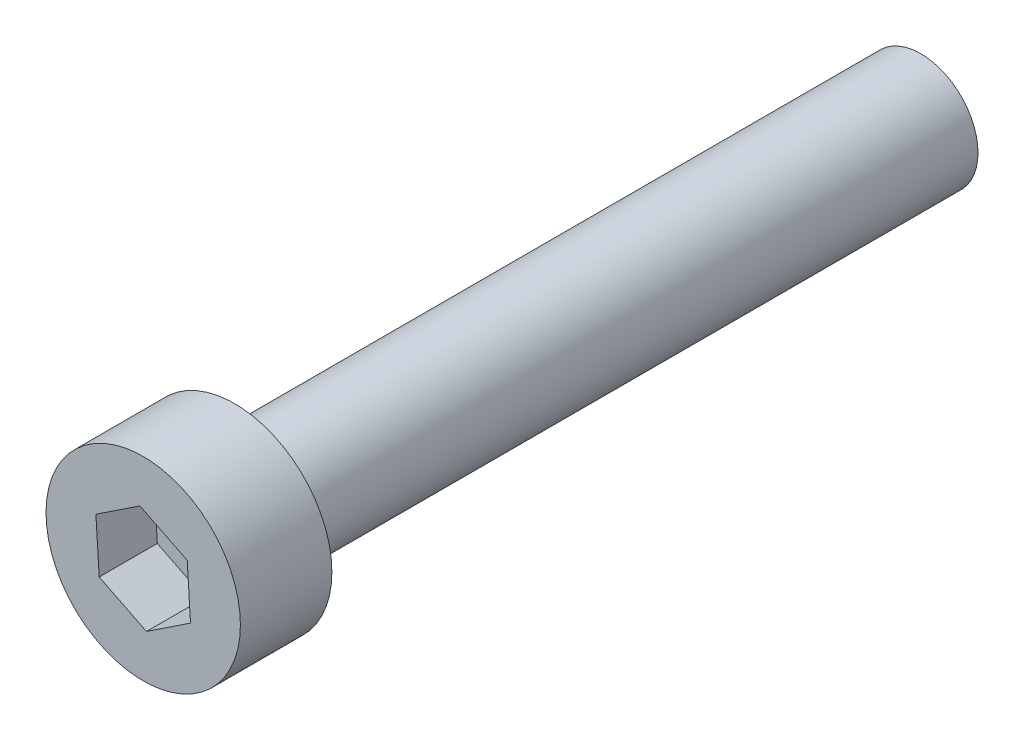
ISO-10303-21;
HEADER;
FILE_DESCRIPTION(('STEP AP214'),'2;1');
FILE_NAME('part.step','',(''),(''),'','','');
FILE_SCHEMA(('AUTOMOTIVE_DESIGN { 1 0 10303 214 1 1 1 1 }'));
ENDSEC;
DATA;
#1=APPLICATION_CONTEXT('core data for automotive mechanical design processes');
#2=APPLICATION_PROTOCOL_DEFINITION('international standard','automotive_design',2000,#1);
#3=PRODUCT_CONTEXT('',#1,'mechanical');
#4=PRODUCT('Part','Part','',(#3));
#5=PRODUCT_RELATED_PRODUCT_CATEGORY('part','',(#4));
#6=PRODUCT_DEFINITION_FORMATION('','',#4);
#7=PRODUCT_DEFINITION_CONTEXT('part definition',#1,'design');
#8=PRODUCT_DEFINITION('design','',#6,#7);
#9=PRODUCT_DEFINITION_SHAPE('','',#8);
#10=(LENGTH_UNIT() NAMED_UNIT(*) SI_UNIT(.MILLI.,.METRE.));
#11=(NAMED_UNIT(*) PLANE_ANGLE_UNIT() SI_UNIT($,.RADIAN.));
#12=(NAMED_UNIT(*) SI_UNIT($,.STERADIAN.) SOLID_ANGLE_UNIT());
#13=UNCERTAINTY_MEASURE_WITH_UNIT(LENGTH_MEASURE(1.E-05),#10,'distance_accuracy_value','');
#14=(GEOMETRIC_REPRESENTATION_CONTEXT(3) GLOBAL_UNCERTAINTY_ASSIGNED_CONTEXT((#13)) GLOBAL_UNIT_ASSIGNED_CONTEXT((#10,
#11,#12)) REPRESENTATION_CONTEXT('',''));
#15=CARTESIAN_POINT('',(0.,0.,0.));
#16=DIRECTION('',(0.,0.,1.));
#17=DIRECTION('',(1.,0.,0.));
#18=AXIS2_PLACEMENT_3D('',#15,#16,#17);
#19=CARTESIAN_POINT('',(0.,0.,30.));
#20=DIRECTION('',(0.,0.,-1.));
#21=DIRECTION('',(-1.,0.,0.));
#22=AXIS2_PLACEMENT_3D('',#19,#20,#21);
#23=CYLINDRICAL_SURFACE('',#22,2.5);
#24=CARTESIAN_POINT('',(0.,0.,30.));
#25=DIRECTION('',(0.,0.,1.));
#26=DIRECTION('',(1.,0.,0.));
#27=AXIS2_PLACEMENT_3D('',#24,#25,#26);
#28=CIRCLE('',#27,2.5);
#29=CARTESIAN_POINT('',(2.5,0.,30.));
#30=VERTEX_POINT('',#29);
#31=EDGE_CURVE('E11',#30,#30,#28,.T.);
#32=ORIENTED_EDGE('',*,*,#31,.F.);
#33=EDGE_LOOP('',(#32));
#34=FACE_BOUND('',#33,.T.);
#35=CARTESIAN_POINT('',(0.,0.,0.));
#36=DIRECTION('',(0.,0.,1.));
#37=DIRECTION('',(1.,0.,0.));
#38=AXIS2_PLACEMENT_3D('',#35,#36,#37);
#39=CIRCLE('',#38,2.5);
#40=CARTESIAN_POINT('',(2.5,0.,0.));
#41=VERTEX_POINT('',#40);
#42=EDGE_CURVE('E34',#41,#41,#39,.T.);
#43=ORIENTED_EDGE('',*,*,#42,.T.);
#44=EDGE_LOOP('',(#43));
#45=FACE_BOUND('',#44,.T.);
#46=ADVANCED_FACE('F31',(#34,#45),#23,.T.);
#47=CARTESIAN_POINT('',(0.,0.,0.));
#48=DIRECTION('',(0.,0.,1.));
#49=DIRECTION('',(1.,0.,0.));
#50=AXIS2_PLACEMENT_3D('',#47,#48,#49);
#51=PLANE('',#50);
#52=ORIENTED_EDGE('',*,*,#42,.F.);
#53=EDGE_LOOP('',(#52));
#54=FACE_BOUND('',#53,.T.);
#55=ADVANCED_FACE('F149',(#54),#51,.F.);
#56=CARTESIAN_POINT('',(0.,0.,30.));
#57=DIRECTION('',(0.,0.,1.));
#58=DIRECTION('',(1.,0.,0.));
#59=AXIS2_PLACEMENT_3D('',#56,#57,#58);
#60=PLANE('',#59);
#61=CARTESIAN_POINT('',(0.,0.,30.));
#62=DIRECTION('',(0.,0.,1.));
#63=DIRECTION('',(1.,0.,0.));
#64=AXIS2_PLACEMENT_3D('',#61,#62,#63);
#65=CIRCLE('',#64,4.25);
#66=CARTESIAN_POINT('',(4.25,0.,30.));
#67=VERTEX_POINT('',#66);
#68=EDGE_CURVE('E132',#67,#67,#65,.T.);
#69=ORIENTED_EDGE('',*,*,#68,.F.);
#70=EDGE_LOOP('',(#69));
#71=FACE_BOUND('',#70,.T.);
#72=ORIENTED_EDGE('',*,*,#31,.T.);
#73=EDGE_LOOP('',(#72));
#74=FACE_BOUND('',#73,.T.);
#75=ADVANCED_FACE('F146',(#71,#74),#60,.F.);
#76=CARTESIAN_POINT('',(0.,0.,34.));
#77=DIRECTION('',(0.,0.,-1.));
#78=DIRECTION('',(-1.,0.,0.));
#79=AXIS2_PLACEMENT_3D('',#76,#77,#78);
#80=CYLINDRICAL_SURFACE('',#79,4.25);
#81=CARTESIAN_POINT('',(0.,0.,34.));
#82=DIRECTION('',(0.,0.,1.));
#83=DIRECTION('',(1.,0.,0.));
#84=AXIS2_PLACEMENT_3D('',#81,#82,#83);
#85=CIRCLE('',#84,4.25);
#86=CARTESIAN_POINT('',(4.25,0.,34.));
#87=VERTEX_POINT('',#86);
#88=EDGE_CURVE('E138',#87,#87,#85,.T.);
#89=ORIENTED_EDGE('',*,*,#88,.F.);
#90=EDGE_LOOP('',(#89));
#91=FACE_BOUND('',#90,.T.);
#92=ORIENTED_EDGE('',*,*,#68,.T.);
#93=EDGE_LOOP('',(#92));
#94=FACE_BOUND('',#93,.T.);
#95=ADVANCED_FACE('F144',(#91,#94),#80,.T.);
#96=CARTESIAN_POINT('',(0.,0.,34.));
#97=DIRECTION('',(0.,0.,1.));
#98=DIRECTION('',(1.,0.,0.));
#99=AXIS2_PLACEMENT_3D('',#96,#97,#98);
#100=PLANE('',#99);
#101=DIRECTION('',(0.833193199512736,0.552981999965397,0.));
#102=VECTOR('',#101,1.);
#103=CARTESIAN_POINT('',(0.143875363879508,-2.30491501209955,34.));
#104=LINE('',#103,#102);
#105=CARTESIAN_POINT('',(0.143875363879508,-2.30491501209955,34.));
#106=VERTEX_POINT('',#105);
#107=CARTESIAN_POINT('',(2.06805263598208,-1.02785778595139,34.));
#108=VERTEX_POINT('',#107);
#109=EDGE_CURVE('E45',#106,#108,#104,.T.);
#110=ORIENTED_EDGE('',*,*,#109,.F.);
#111=DIRECTION('',(0.895493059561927,-0.445075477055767,0.));
#112=VECTOR('',#111,1.);
#113=CARTESIAN_POINT('',(-1.92417727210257,-1.27705722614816,34.));
#114=LINE('',#113,#112);
#115=CARTESIAN_POINT('',(-1.92417727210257,-1.27705722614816,34.));
#116=VERTEX_POINT('',#115);
#117=EDGE_CURVE('E128',#116,#106,#114,.T.);
#118=ORIENTED_EDGE('',*,*,#117,.F.);
#119=DIRECTION('',(0.062299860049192,-0.998057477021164,0.));
#120=VECTOR('',#119,1.);
#121=CARTESIAN_POINT('',(-2.06805263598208,1.02785778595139,34.));
#122=LINE('',#121,#120);
#123=CARTESIAN_POINT('',(-2.06805263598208,1.02785778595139,34.));
#124=VERTEX_POINT('',#123);
#125=EDGE_CURVE('E126',#124,#116,#122,.T.);
#126=ORIENTED_EDGE('',*,*,#125,.F.);
#127=DIRECTION('',(-0.833193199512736,-0.552981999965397,0.));
#128=VECTOR('',#127,1.);
#129=CARTESIAN_POINT('',(-0.143875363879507,2.30491501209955,34.));
#130=LINE('',#129,#128);
#131=CARTESIAN_POINT('',(-0.143875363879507,2.30491501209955,34.));
#132=VERTEX_POINT('',#131);
#133=EDGE_CURVE('E93',#132,#124,#130,.T.);
#134=ORIENTED_EDGE('',*,*,#133,.F.);
#135=DIRECTION('',(-0.895493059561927,0.445075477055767,0.));
#136=VECTOR('',#135,1.);
#137=CARTESIAN_POINT('',(1.92417727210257,1.27705722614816,34.));
#138=LINE('',#137,#136);
#139=CARTESIAN_POINT('',(1.92417727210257,1.27705722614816,34.));
#140=VERTEX_POINT('',#139);
#141=EDGE_CURVE('E122',#140,#132,#138,.T.);
#142=ORIENTED_EDGE('',*,*,#141,.F.);
#143=DIRECTION('',(-0.0622998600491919,0.998057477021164,0.));
#144=VECTOR('',#143,1.);
#145=CARTESIAN_POINT('',(2.06805263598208,-1.02785778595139,34.));
#146=LINE('',#145,#144);
#147=EDGE_CURVE('E119',#108,#140,#146,.T.);
#148=ORIENTED_EDGE('',*,*,#147,.F.);
#149=EDGE_LOOP('',(#110,#118,#126,#134,#142,#148));
#150=FACE_BOUND('',#149,.T.);
#151=ORIENTED_EDGE('',*,*,#88,.T.);
#152=EDGE_LOOP('',(#151));
#153=FACE_BOUND('',#152,.T.);
#154=ADVANCED_FACE('F163',(#150,#153),#100,.T.);
#155=CARTESIAN_POINT('',(0.143875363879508,-2.30491501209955,31.46));
#156=DIRECTION('',(0.552981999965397,-0.833193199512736,0.));
#157=DIRECTION('',(0.833193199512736,0.552981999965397,0.));
#158=AXIS2_PLACEMENT_3D('',#155,#156,#157);
#159=PLANE('',#158);
#160=ORIENTED_EDGE('',*,*,#109,.T.);
#161=DIRECTION('',(0.,0.,1.));
#162=VECTOR('',#161,1.);
#163=CARTESIAN_POINT('',(2.06805263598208,-1.02785778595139,31.46));
#164=LINE('',#163,#162);
#165=CARTESIAN_POINT('',(2.06805263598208,-1.02785778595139,31.46));
#166=VERTEX_POINT('',#165);
#167=EDGE_CURVE('E75',#166,#108,#164,.T.);
#168=ORIENTED_EDGE('',*,*,#167,.F.);
#169=DIRECTION('',(0.833193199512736,0.552981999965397,0.));
#170=VECTOR('',#169,1.);
#171=CARTESIAN_POINT('',(0.143875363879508,-2.30491501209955,31.46));
#172=LINE('',#171,#170);
#173=CARTESIAN_POINT('',(0.143875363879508,-2.30491501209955,31.46));
#174=VERTEX_POINT('',#173);
#175=EDGE_CURVE('E130',#174,#166,#172,.T.);
#176=ORIENTED_EDGE('',*,*,#175,.F.);
#177=DIRECTION('',(0.,0.,1.));
#178=VECTOR('',#177,1.);
#179=CARTESIAN_POINT('',(0.143875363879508,-2.30491501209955,31.46));
#180=LINE('',#179,#178);
#181=EDGE_CURVE('E53',#174,#106,#180,.T.);
#182=ORIENTED_EDGE('',*,*,#181,.T.);
#183=EDGE_LOOP('',(#160,#168,#176,#182));
#184=FACE_BOUND('',#183,.T.);
#185=ADVANCED_FACE('F168',(#184),#159,.F.);
#186=CARTESIAN_POINT('',(-1.92417727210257,-1.27705722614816,31.46));
#187=DIRECTION('',(-0.445075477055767,-0.895493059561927,0.));
#188=DIRECTION('',(0.895493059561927,-0.445075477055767,0.));
#189=AXIS2_PLACEMENT_3D('',#186,#187,#188);
#190=PLANE('',#189);
#191=ORIENTED_EDGE('',*,*,#117,.T.);
#192=ORIENTED_EDGE('',*,*,#181,.F.);
#193=DIRECTION('',(0.895493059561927,-0.445075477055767,0.));
#194=VECTOR('',#193,1.);
#195=CARTESIAN_POINT('',(-1.92417727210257,-1.27705722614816,31.46));
#196=LINE('',#195,#194);
#197=CARTESIAN_POINT('',(-1.92417727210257,-1.27705722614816,31.46));
#198=VERTEX_POINT('',#197);
#199=EDGE_CURVE('E105',#198,#174,#196,.T.);
#200=ORIENTED_EDGE('',*,*,#199,.F.);
#201=DIRECTION('',(0.,0.,1.));
#202=VECTOR('',#201,1.);
#203=CARTESIAN_POINT('',(-1.92417727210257,-1.27705722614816,31.46));
#204=LINE('',#203,#202);
#205=EDGE_CURVE('E97',#198,#116,#204,.T.);
#206=ORIENTED_EDGE('',*,*,#205,.T.);
#207=EDGE_LOOP('',(#191,#192,#200,#206));
#208=FACE_BOUND('',#207,.T.);
#209=ADVANCED_FACE('F172',(#208),#190,.F.);
#210=CARTESIAN_POINT('',(-2.06805263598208,1.02785778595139,31.46));
#211=DIRECTION('',(-0.998057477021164,-0.062299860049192,0.));
#212=DIRECTION('',(0.062299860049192,-0.998057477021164,0.));
#213=AXIS2_PLACEMENT_3D('',#210,#211,#212);
#214=PLANE('',#213);
#215=ORIENTED_EDGE('',*,*,#125,.T.);
#216=ORIENTED_EDGE('',*,*,#205,.F.);
#217=DIRECTION('',(0.062299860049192,-0.998057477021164,0.));
#218=VECTOR('',#217,1.);
#219=CARTESIAN_POINT('',(-2.06805263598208,1.02785778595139,31.46));
#220=LINE('',#219,#218);
#221=CARTESIAN_POINT('',(-2.06805263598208,1.02785778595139,31.46));
#222=VERTEX_POINT('',#221);
#223=EDGE_CURVE('E101',#222,#198,#220,.T.);
#224=ORIENTED_EDGE('',*,*,#223,.F.);
#225=DIRECTION('',(0.,0.,1.));
#226=VECTOR('',#225,1.);
#227=CARTESIAN_POINT('',(-2.06805263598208,1.02785778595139,31.46));
#228=LINE('',#227,#226);
#229=EDGE_CURVE('E86',#222,#124,#228,.T.);
#230=ORIENTED_EDGE('',*,*,#229,.T.);
#231=EDGE_LOOP('',(#215,#216,#224,#230));
#232=FACE_BOUND('',#231,.T.);
#233=ADVANCED_FACE('F102',(#232),#214,.F.);
#234=CARTESIAN_POINT('',(-0.143875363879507,2.30491501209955,31.46));
#235=DIRECTION('',(-0.552981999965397,0.833193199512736,0.));
#236=DIRECTION('',(-0.833193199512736,-0.552981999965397,0.));
#237=AXIS2_PLACEMENT_3D('',#234,#235,#236);
#238=PLANE('',#237);
#239=ORIENTED_EDGE('',*,*,#133,.T.);
#240=ORIENTED_EDGE('',*,*,#229,.F.);
#241=DIRECTION('',(-0.833193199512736,-0.552981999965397,0.));
#242=VECTOR('',#241,1.);
#243=CARTESIAN_POINT('',(-0.143875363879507,2.30491501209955,31.46));
#244=LINE('',#243,#242);
#245=CARTESIAN_POINT('',(-0.143875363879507,2.30491501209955,31.46));
#246=VERTEX_POINT('',#245);
#247=EDGE_CURVE('E90',#246,#222,#244,.T.);
#248=ORIENTED_EDGE('',*,*,#247,.F.);
#249=DIRECTION('',(0.,0.,1.));
#250=VECTOR('',#249,1.);
#251=CARTESIAN_POINT('',(-0.143875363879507,2.30491501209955,31.46));
#252=LINE('',#251,#250);
#253=EDGE_CURVE('E98',#246,#132,#252,.T.);
#254=ORIENTED_EDGE('',*,*,#253,.T.);
#255=EDGE_LOOP('',(#239,#240,#248,#254));
#256=FACE_BOUND('',#255,.T.);
#257=ADVANCED_FACE('F88',(#256),#238,.F.);
#258=CARTESIAN_POINT('',(1.92417727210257,1.27705722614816,31.46));
#259=DIRECTION('',(0.445075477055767,0.895493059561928,0.));
#260=DIRECTION('',(-0.895493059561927,0.445075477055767,0.));
#261=AXIS2_PLACEMENT_3D('',#258,#259,#260);
#262=PLANE('',#261);
#263=ORIENTED_EDGE('',*,*,#141,.T.);
#264=ORIENTED_EDGE('',*,*,#253,.F.);
#265=DIRECTION('',(-0.895493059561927,0.445075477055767,0.));
#266=VECTOR('',#265,1.);
#267=CARTESIAN_POINT('',(1.92417727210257,1.27705722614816,31.46));
#268=LINE('',#267,#266);
#269=CARTESIAN_POINT('',(1.92417727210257,1.27705722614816,31.46));
#270=VERTEX_POINT('',#269);
#271=EDGE_CURVE('E111',#270,#246,#268,.T.);
#272=ORIENTED_EDGE('',*,*,#271,.F.);
#273=DIRECTION('',(0.,0.,1.));
#274=VECTOR('',#273,1.);
#275=CARTESIAN_POINT('',(1.92417727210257,1.27705722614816,31.46));
#276=LINE('',#275,#274);
#277=EDGE_CURVE('E135',#270,#140,#276,.T.);
#278=ORIENTED_EDGE('',*,*,#277,.T.);
#279=EDGE_LOOP('',(#263,#264,#272,#278));
#280=FACE_BOUND('',#279,.T.);
#281=ADVANCED_FACE('F176',(#280),#262,.F.);
#282=CARTESIAN_POINT('',(2.06805263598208,-1.02785778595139,31.46));
#283=DIRECTION('',(0.998057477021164,0.0622998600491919,0.));
#284=DIRECTION('',(-0.0622998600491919,0.998057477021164,0.));
#285=AXIS2_PLACEMENT_3D('',#282,#283,#284);
#286=PLANE('',#285);
#287=ORIENTED_EDGE('',*,*,#147,.T.);
#288=ORIENTED_EDGE('',*,*,#277,.F.);
#289=DIRECTION('',(-0.0622998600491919,0.998057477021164,0.));
#290=VECTOR('',#289,1.);
#291=CARTESIAN_POINT('',(2.06805263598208,-1.02785778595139,31.46));
#292=LINE('',#291,#290);
#293=EDGE_CURVE('E113',#166,#270,#292,.T.);
#294=ORIENTED_EDGE('',*,*,#293,.F.);
#295=ORIENTED_EDGE('',*,*,#167,.T.);
#296=EDGE_LOOP('',(#287,#288,#294,#295));
#297=FACE_BOUND('',#296,.T.);
#298=ADVANCED_FACE('F173',(#297),#286,.F.);
#299=CARTESIAN_POINT('',(2.06805263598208,-1.02785778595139,31.46));
#300=DIRECTION('',(0.,0.,1.));
#301=DIRECTION('',(1.,0.,0.));
#302=AXIS2_PLACEMENT_3D('',#299,#300,#301);
#303=PLANE('',#302);
#304=ORIENTED_EDGE('',*,*,#175,.T.);
#305=ORIENTED_EDGE('',*,*,#293,.T.);
#306=ORIENTED_EDGE('',*,*,#271,.T.);
#307=ORIENTED_EDGE('',*,*,#247,.T.);
#308=ORIENTED_EDGE('',*,*,#223,.T.);
#309=ORIENTED_EDGE('',*,*,#199,.T.);
#310=EDGE_LOOP('',(#304,#305,#306,#307,#308,#309));
#311=FACE_BOUND('',#310,.T.);
#312=ADVANCED_FACE('F108',(#311),#303,.T.);
#313=CLOSED_SHELL('',(#46,#55,#75,#95,#154,#185,#209,#233,#257,#281,#298,#312));
#314=MANIFOLD_SOLID_BREP('B2',#313);
#315=ADVANCED_BREP_SHAPE_REPRESENTATION('',(#18,#314),#14);
#316=SHAPE_DEFINITION_REPRESENTATION(#9,#315);
ENDSEC;
END-ISO-10303-21;
